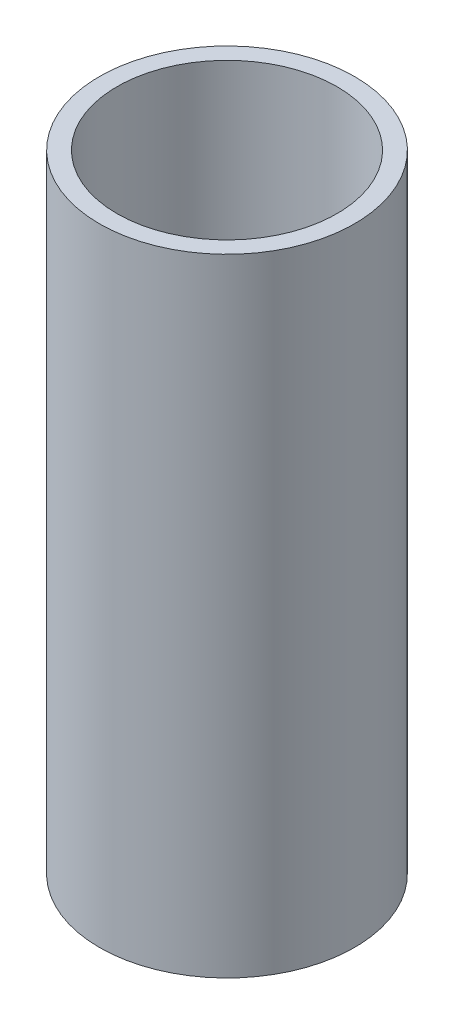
ISO-10303-21;
HEADER;
FILE_DESCRIPTION(('STEP AP214'),'2;1');
FILE_NAME('part.step','',(''),(''),'','','');
FILE_SCHEMA(('AUTOMOTIVE_DESIGN { 1 0 10303 214 1 1 1 1 }'));
ENDSEC;
DATA;
#1=APPLICATION_CONTEXT('core data for automotive mechanical design processes');
#2=APPLICATION_PROTOCOL_DEFINITION('international standard','automotive_design',2000,#1);
#3=PRODUCT_CONTEXT('',#1,'mechanical');
#4=PRODUCT('Part','Part','',(#3));
#5=PRODUCT_RELATED_PRODUCT_CATEGORY('part','',(#4));
#6=PRODUCT_DEFINITION_FORMATION('','',#4);
#7=PRODUCT_DEFINITION_CONTEXT('part definition',#1,'design');
#8=PRODUCT_DEFINITION('design','',#6,#7);
#9=PRODUCT_DEFINITION_SHAPE('','',#8);
#10=(LENGTH_UNIT() NAMED_UNIT(*) SI_UNIT(.MILLI.,.METRE.));
#11=(NAMED_UNIT(*) PLANE_ANGLE_UNIT() SI_UNIT($,.RADIAN.));
#12=(NAMED_UNIT(*) SI_UNIT($,.STERADIAN.) SOLID_ANGLE_UNIT());
#13=UNCERTAINTY_MEASURE_WITH_UNIT(LENGTH_MEASURE(1.E-05),#10,'distance_accuracy_value','');
#14=(GEOMETRIC_REPRESENTATION_CONTEXT(3) GLOBAL_UNCERTAINTY_ASSIGNED_CONTEXT((#13)) GLOBAL_UNIT_ASSIGNED_CONTEXT((#10,
#11,#12)) REPRESENTATION_CONTEXT('',''));
#15=CARTESIAN_POINT('',(0.,0.,0.));
#16=DIRECTION('',(0.,0.,1.));
#17=DIRECTION('',(1.,0.,0.));
#18=AXIS2_PLACEMENT_3D('',#15,#16,#17);
#19=CARTESIAN_POINT('',(0.,179.07,0.));
#20=DIRECTION('',(0.,1.,0.));
#21=DIRECTION('',(0.,0.,1.));
#22=AXIS2_PLACEMENT_3D('',#19,#20,#21);
#23=PLANE('',#22);
#24=CARTESIAN_POINT('',(0.,179.07,0.));
#25=DIRECTION('',(0.,1.,0.));
#26=DIRECTION('',(0.,0.,1.));
#27=AXIS2_PLACEMENT_3D('',#24,#25,#26);
#28=CIRCLE('',#27,36.449);
#29=CARTESIAN_POINT('',(0.,179.07,36.449));
#30=VERTEX_POINT('',#29);
#31=EDGE_CURVE('E10',#30,#30,#28,.T.);
#32=ORIENTED_EDGE('',*,*,#31,.T.);
#33=EDGE_LOOP('',(#32));
#34=FACE_BOUND('',#33,.T.);
#35=CARTESIAN_POINT('',(0.,179.07,0.));
#36=DIRECTION('',(0.,1.,0.));
#37=DIRECTION('',(0.,0.,1.));
#38=AXIS2_PLACEMENT_3D('',#35,#36,#37);
#39=CIRCLE('',#38,31.4325);
#40=CARTESIAN_POINT('',(0.,179.07,31.4325));
#41=VERTEX_POINT('',#40);
#42=EDGE_CURVE('E41',#41,#41,#39,.T.);
#43=ORIENTED_EDGE('',*,*,#42,.F.);
#44=EDGE_LOOP('',(#43));
#45=FACE_BOUND('',#44,.T.);
#46=ADVANCED_FACE('F30',(#34,#45),#23,.T.);
#47=CARTESIAN_POINT('',(0.,0.,0.));
#48=DIRECTION('',(0.,1.,0.));
#49=DIRECTION('',(0.,0.,1.));
#50=AXIS2_PLACEMENT_3D('',#47,#48,#49);
#51=PLANE('',#50);
#52=CARTESIAN_POINT('',(0.,0.,0.));
#53=DIRECTION('',(0.,1.,0.));
#54=DIRECTION('',(0.,0.,1.));
#55=AXIS2_PLACEMENT_3D('',#52,#53,#54);
#56=CIRCLE('',#55,36.449);
#57=CARTESIAN_POINT('',(0.,0.,36.449));
#58=VERTEX_POINT('',#57);
#59=EDGE_CURVE('E37',#58,#58,#56,.T.);
#60=ORIENTED_EDGE('',*,*,#59,.F.);
#61=EDGE_LOOP('',(#60));
#62=FACE_BOUND('',#61,.T.);
#63=CARTESIAN_POINT('',(0.,0.,0.));
#64=DIRECTION('',(0.,1.,0.));
#65=DIRECTION('',(0.,0.,1.));
#66=AXIS2_PLACEMENT_3D('',#63,#64,#65);
#67=CIRCLE('',#66,31.4325);
#68=CARTESIAN_POINT('',(0.,0.,31.4325));
#69=VERTEX_POINT('',#68);
#70=EDGE_CURVE('E45',#69,#69,#67,.T.);
#71=ORIENTED_EDGE('',*,*,#70,.T.);
#72=EDGE_LOOP('',(#71));
#73=FACE_BOUND('',#72,.T.);
#74=ADVANCED_FACE('F51',(#62,#73),#51,.F.);
#75=CARTESIAN_POINT('',(0.,179.07,0.));
#76=DIRECTION('',(0.,-1.,0.));
#77=DIRECTION('',(0.,0.,-1.));
#78=AXIS2_PLACEMENT_3D('',#75,#76,#77);
#79=CYLINDRICAL_SURFACE('',#78,36.449);
#80=ORIENTED_EDGE('',*,*,#31,.F.);
#81=EDGE_LOOP('',(#80));
#82=FACE_BOUND('',#81,.T.);
#83=ORIENTED_EDGE('',*,*,#59,.T.);
#84=EDGE_LOOP('',(#83));
#85=FACE_BOUND('',#84,.T.);
#86=ADVANCED_FACE('F32',(#82,#85),#79,.T.);
#87=CARTESIAN_POINT('',(0.,179.07,0.));
#88=DIRECTION('',(0.,-1.,0.));
#89=DIRECTION('',(0.,0.,-1.));
#90=AXIS2_PLACEMENT_3D('',#87,#88,#89);
#91=CYLINDRICAL_SURFACE('',#90,31.4325);
#92=ORIENTED_EDGE('',*,*,#42,.T.);
#93=EDGE_LOOP('',(#92));
#94=FACE_BOUND('',#93,.T.);
#95=ORIENTED_EDGE('',*,*,#70,.F.);
#96=EDGE_LOOP('',(#95));
#97=FACE_BOUND('',#96,.T.);
#98=ADVANCED_FACE('F53',(#94,#97),#91,.F.);
#99=CLOSED_SHELL('',(#46,#74,#86,#98));
#100=MANIFOLD_SOLID_BREP('B2',#99);
#101=ADVANCED_BREP_SHAPE_REPRESENTATION('',(#18,#100),#14);
#102=SHAPE_DEFINITION_REPRESENTATION(#9,#101);
ENDSEC;
END-ISO-10303-21;
